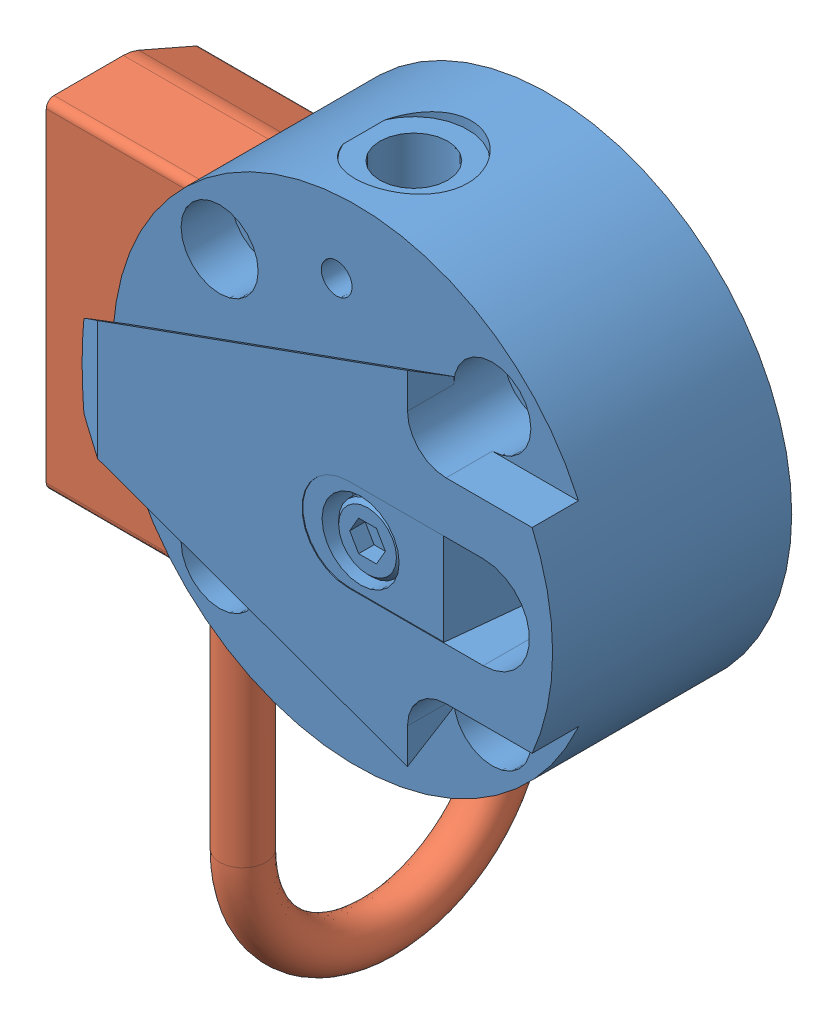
SolidWorks assembly SSR-RMEF1610.sldasm, configuration Default (file format 15000). Lengths in mm.
Overall size (72.86 116.33 62.07).
2 component instances, 2 part files, 0 mates.
Components (placement in the parent):
- SSR-RMEF1610_01-1: SSR-RMEF1610_01.SLDPRT [ﾃﾞﾌｫﾙﾄ] at origin size (63 63 36.5)
- SSR-RMEF1610_02-1: SSR-RMEF1610_02.SLDPRT [ﾃﾞﾌｫﾙﾄ] at (0 0 23.8) size (23.55 106.83 54.87)
